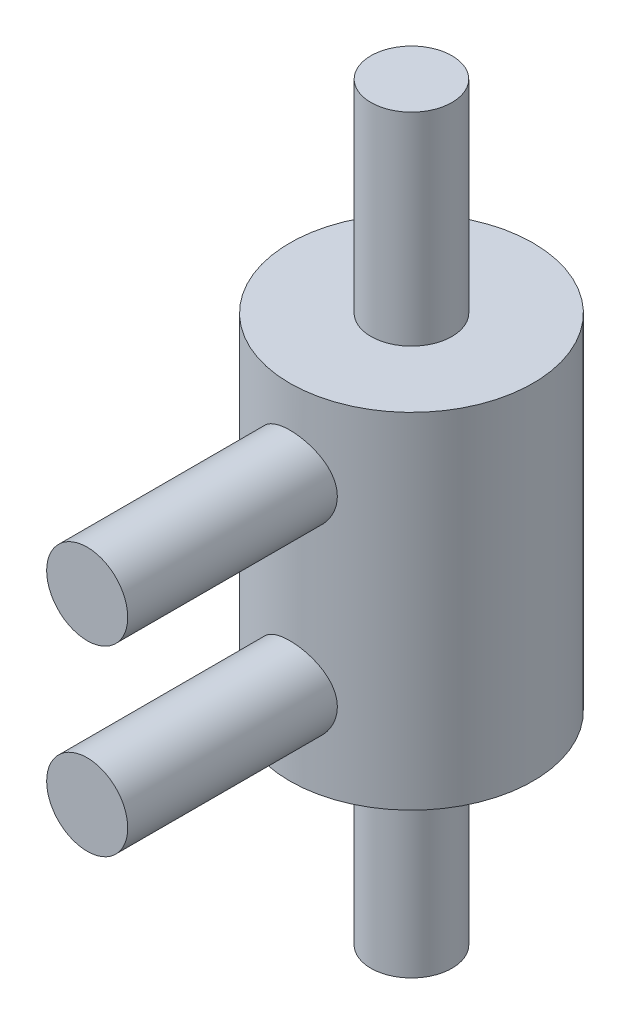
from build123d import *

# Parameters (mm, degrees)
SKETCH_1_R      = 6
EXTRUDE_1_DEPTH = 17
SKETCH_2_R      = 2
EXTRUDE_2_DEPTH = 10
SKETCH_3_R      = 2
EXTRUDE_3_DEPTH = 16


with BuildPart() as part:
    # Sketch 1 → Extrude 1 (new body)
    with BuildSketch(Plane(origin=(0, 0, 0), x_dir=(1, 0, 0), z_dir=(0, 1, 0))):
        with Locations(Location((0, 0, 0), (0, 0, 270))):
            Circle(SKETCH_1_R)
    extrude(amount=EXTRUDE_1_DEPTH)

    # Sketch 2 → Extrude 2 (add)
    with BuildSketch(Plane(origin=(0, 17, 0), x_dir=(1, 0, 0), z_dir=(0, 1, 0))):
        with Locations(Location((0, 0, 0), (0, 0, 270))):
            Circle(SKETCH_2_R)
    extrude_2 = extrude(amount=EXTRUDE_2_DEPTH)

    # Sketch 3 → Extrude 3 (add)
    with BuildSketch(Plane.XY):
        with Locations(Location((0, 13, 0), (0, 0, 180))):
            Circle(SKETCH_3_R)
    extrude_3 = extrude(amount=EXTRUDE_3_DEPTH)

    # Mirror 1: Extrude 2, Extrude 3 across plane
    add(extrude_2.mirror(Plane.ZX.offset(8.5)))
    add(extrude_3.mirror(Plane.ZX.offset(8.5)))


solid = part.part
